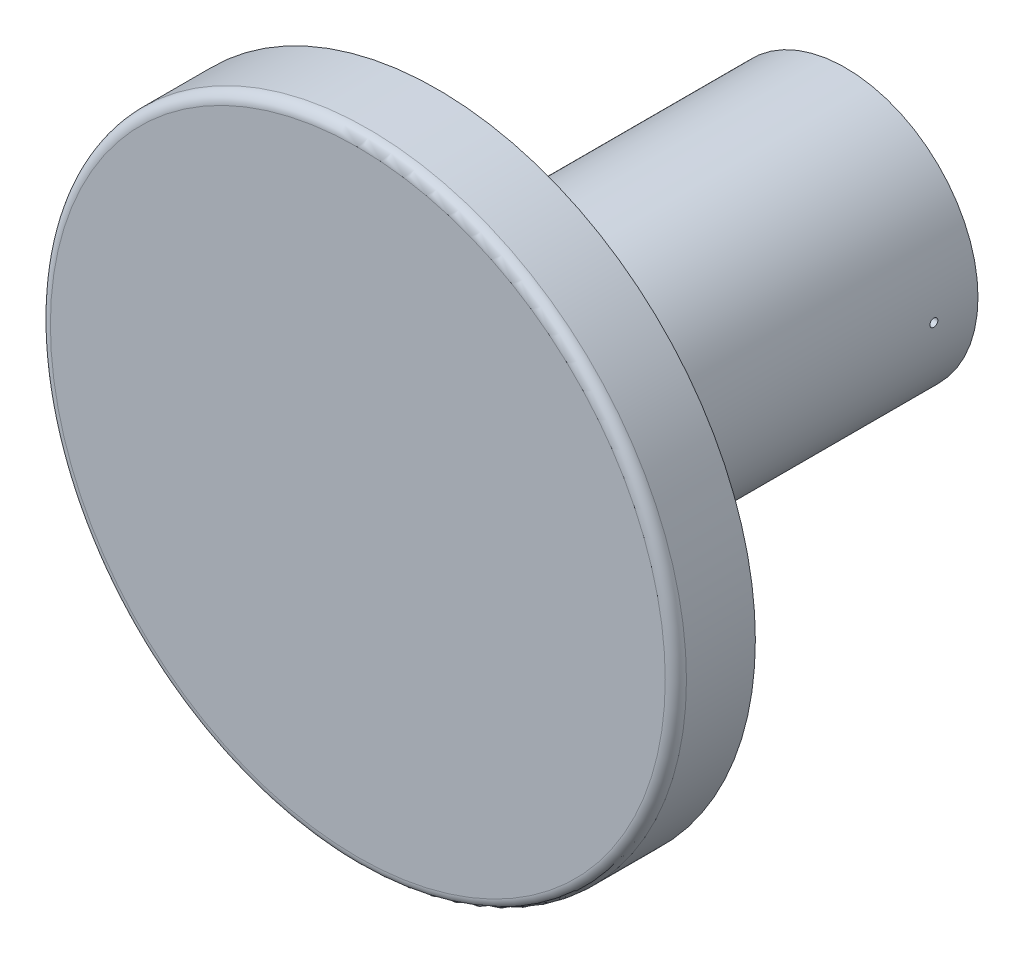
ISO-10303-21;
HEADER;
FILE_DESCRIPTION(('STEP AP214'),'2;1');
FILE_NAME('part.step','',(''),(''),'','','');
FILE_SCHEMA(('AUTOMOTIVE_DESIGN { 1 0 10303 214 1 1 1 1 }'));
ENDSEC;
DATA;
#1=APPLICATION_CONTEXT('core data for automotive mechanical design processes');
#2=APPLICATION_PROTOCOL_DEFINITION('international standard','automotive_design',2000,#1);
#3=PRODUCT_CONTEXT('',#1,'mechanical');
#4=PRODUCT('Part','Part','',(#3));
#5=PRODUCT_RELATED_PRODUCT_CATEGORY('part','',(#4));
#6=PRODUCT_DEFINITION_FORMATION('','',#4);
#7=PRODUCT_DEFINITION_CONTEXT('part definition',#1,'design');
#8=PRODUCT_DEFINITION('design','',#6,#7);
#9=PRODUCT_DEFINITION_SHAPE('','',#8);
#10=(LENGTH_UNIT() NAMED_UNIT(*) SI_UNIT(.MILLI.,.METRE.));
#11=(NAMED_UNIT(*) PLANE_ANGLE_UNIT() SI_UNIT($,.RADIAN.));
#12=(NAMED_UNIT(*) SI_UNIT($,.STERADIAN.) SOLID_ANGLE_UNIT());
#13=UNCERTAINTY_MEASURE_WITH_UNIT(LENGTH_MEASURE(1.E-05),#10,'distance_accuracy_value','');
#14=(GEOMETRIC_REPRESENTATION_CONTEXT(3) GLOBAL_UNCERTAINTY_ASSIGNED_CONTEXT((#13)) GLOBAL_UNIT_ASSIGNED_CONTEXT((#10,
#11,#12)) REPRESENTATION_CONTEXT('',''));
#15=CARTESIAN_POINT('',(0.,0.,0.));
#16=DIRECTION('',(0.,0.,1.));
#17=DIRECTION('',(1.,0.,0.));
#18=AXIS2_PLACEMENT_3D('',#15,#16,#17);
#19=CARTESIAN_POINT('',(0.,6.,7.5));
#20=DIRECTION('',(0.,0.,-1.));
#21=DIRECTION('',(-1.,0.,0.));
#22=AXIS2_PLACEMENT_3D('',#19,#20,#21);
#23=CYLINDRICAL_SURFACE('',#22,2.5);
#24=CARTESIAN_POINT('',(0.,6.,7.5));
#25=DIRECTION('',(0.,0.,1.));
#26=DIRECTION('',(1.,0.,0.));
#27=AXIS2_PLACEMENT_3D('',#24,#25,#26);
#28=CIRCLE('',#27,2.5);
#29=CARTESIAN_POINT('',(2.5,6.,7.5));
#30=VERTEX_POINT('',#29);
#31=EDGE_CURVE('E11',#30,#30,#28,.T.);
#32=ORIENTED_EDGE('',*,*,#31,.F.);
#33=EDGE_LOOP('',(#32));
#34=FACE_BOUND('',#33,.T.);
#35=CARTESIAN_POINT('',(0.,6.,0.));
#36=DIRECTION('',(0.,0.,1.));
#37=DIRECTION('',(1.,0.,0.));
#38=AXIS2_PLACEMENT_3D('',#35,#36,#37);
#39=CIRCLE('',#38,2.5);
#40=CARTESIAN_POINT('',(2.5,6.,0.));
#41=VERTEX_POINT('',#40);
#42=EDGE_CURVE('E58',#41,#41,#39,.T.);
#43=ORIENTED_EDGE('',*,*,#42,.T.);
#44=EDGE_LOOP('',(#43));
#45=FACE_BOUND('',#44,.T.);
#46=CARTESIAN_POINT('',(2.5,6.,0.907063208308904));
#47=CARTESIAN_POINT('',(2.49999998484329,5.99578823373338,0.907063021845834));
#48=CARTESIAN_POINT('',(2.49998924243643,5.99157343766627,0.906707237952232));
#49=CARTESIAN_POINT('',(2.49994742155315,5.9832599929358,0.905292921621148));
#50=CARTESIAN_POINT('',(2.4999163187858,5.97916148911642,0.904233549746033));
#51=CARTESIAN_POINT('',(2.49983729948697,5.9712022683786,0.901442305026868));
#52=CARTESIAN_POINT('',(2.49978939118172,5.96734143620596,0.899710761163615));
#53=CARTESIAN_POINT('',(2.49968216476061,5.95996632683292,0.895624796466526));
#54=CARTESIAN_POINT('',(2.499622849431,5.9564519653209,0.893270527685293));
#55=CARTESIAN_POINT('',(2.49949945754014,5.94986687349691,0.88800468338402));
#56=CARTESIAN_POINT('',(2.49943537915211,5.9467963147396,0.885092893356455));
#57=CARTESIAN_POINT('',(2.49930969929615,5.94118743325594,0.878795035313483));
#58=CARTESIAN_POINT('',(2.49924809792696,5.93864913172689,0.875408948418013));
#59=CARTESIAN_POINT('',(2.4991343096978,5.93417655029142,0.868257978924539));
#60=CARTESIAN_POINT('',(2.49908212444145,5.93224237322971,0.864493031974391));
#61=CARTESIAN_POINT('',(2.49899306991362,5.9290336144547,0.85669167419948));
#62=CARTESIAN_POINT('',(2.49895620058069,5.92775903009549,0.852655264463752));
#63=CARTESIAN_POINT('',(2.49890194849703,5.92590600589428,0.844426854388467));
#64=CARTESIAN_POINT('',(2.49888455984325,5.92532735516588,0.840234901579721));
#65=CARTESIAN_POINT('',(2.49887121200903,5.92488197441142,0.831813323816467));
#66=CARTESIAN_POINT('',(2.49887525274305,5.92501524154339,0.827583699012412));
#67=CARTESIAN_POINT('',(2.49890430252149,5.92598973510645,0.819208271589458));
#68=CARTESIAN_POINT('',(2.49892930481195,5.92683073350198,0.815062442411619));
#69=CARTESIAN_POINT('',(2.49899744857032,5.9291964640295,0.806970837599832));
#70=CARTESIAN_POINT('',(2.49904059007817,5.93072119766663,0.80302506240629));
#71=CARTESIAN_POINT('',(2.4991401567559,5.93441137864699,0.795444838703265));
#72=CARTESIAN_POINT('',(2.49919658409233,5.93657693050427,0.791810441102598));
#73=CARTESIAN_POINT('',(2.49931635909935,5.94148719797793,0.784956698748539));
#74=CARTESIAN_POINT('',(2.49937970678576,5.94423191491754,0.781737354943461));
#75=CARTESIAN_POINT('',(2.49950621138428,5.95022389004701,0.775803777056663));
#76=CARTESIAN_POINT('',(2.4995693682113,5.95347134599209,0.773089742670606));
#77=CARTESIAN_POINT('',(2.49968834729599,5.96037591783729,0.768245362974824));
#78=CARTESIAN_POINT('',(2.49974416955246,5.9640330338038,0.766115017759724));
#79=CARTESIAN_POINT('',(2.4998421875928,5.97165322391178,0.762498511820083));
#80=CARTESIAN_POINT('',(2.49988438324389,5.97561630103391,0.761012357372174));
#81=CARTESIAN_POINT('',(2.49995038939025,5.98373586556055,0.758726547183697));
#82=CARTESIAN_POINT('',(2.49997419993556,5.98789235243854,0.757926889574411));
#83=CARTESIAN_POINT('',(2.50000074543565,5.99627901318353,0.757037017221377));
#84=CARTESIAN_POINT('',(2.50000348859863,6.00050915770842,0.756946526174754));
#85=CARTESIAN_POINT('',(2.49998761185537,6.00892457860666,0.757476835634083));
#86=CARTESIAN_POINT('',(2.49996899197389,6.013109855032,0.75809763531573));
#87=CARTESIAN_POINT('',(2.49991249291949,6.02131596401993,0.760032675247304));
#88=CARTESIAN_POINT('',(2.49987461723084,6.02533682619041,0.761346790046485));
#89=CARTESIAN_POINT('',(2.49978387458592,6.03310087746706,0.76463102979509));
#90=CARTESIAN_POINT('',(2.49973100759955,6.03684406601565,0.76660115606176));
#91=CARTESIAN_POINT('',(2.49961621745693,6.04394778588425,0.771142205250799));
#92=CARTESIAN_POINT('',(2.49955429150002,6.04730819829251,0.773713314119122));
#93=CARTESIAN_POINT('',(2.49942837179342,6.05354978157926,0.779383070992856));
#94=CARTESIAN_POINT('',(2.49936437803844,6.05643095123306,0.782481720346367));
#95=CARTESIAN_POINT('',(2.49924151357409,6.06163318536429,0.789119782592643));
#96=CARTESIAN_POINT('',(2.49918264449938,6.06395407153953,0.792659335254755));
#97=CARTESIAN_POINT('',(2.49907669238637,6.06796863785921,0.80007801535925));
#98=CARTESIAN_POINT('',(2.49902960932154,6.06966231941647,0.803957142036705));
#99=CARTESIAN_POINT('',(2.49895254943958,6.07237408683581,0.811944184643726));
#100=CARTESIAN_POINT('',(2.49892256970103,6.07339228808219,0.816052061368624));
#101=CARTESIAN_POINT('',(2.49888308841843,6.07472457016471,0.824380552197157));
#102=CARTESIAN_POINT('',(2.49887358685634,6.07503865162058,0.828601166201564));
#103=CARTESIAN_POINT('',(2.4988761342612,6.07495376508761,0.837033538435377));
#104=CARTESIAN_POINT('',(2.498888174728,6.07455507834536,0.841245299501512));
#105=CARTESIAN_POINT('',(2.49893243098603,6.07305655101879,0.849542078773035));
#106=CARTESIAN_POINT('',(2.49896464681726,6.07195670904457,0.853627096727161));
#107=CARTESIAN_POINT('',(2.4990456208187,6.06908713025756,0.861554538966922));
#108=CARTESIAN_POINT('',(2.49909437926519,6.06731738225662,0.865396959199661));
#109=CARTESIAN_POINT('',(2.49920293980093,6.06315832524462,0.872730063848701));
#110=CARTESIAN_POINT('',(2.49926274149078,6.06076903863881,0.876220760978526));
#111=CARTESIAN_POINT('',(2.49938667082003,6.05543790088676,0.882752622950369));
#112=CARTESIAN_POINT('',(2.49945079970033,6.05249589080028,0.885793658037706));
#113=CARTESIAN_POINT('',(2.49957615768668,6.04614223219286,0.891339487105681));
#114=CARTESIAN_POINT('',(2.49963738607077,6.0427304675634,0.893844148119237));
#115=CARTESIAN_POINT('',(2.49975006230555,6.03553281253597,0.898246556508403));
#116=CARTESIAN_POINT('',(2.49980150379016,6.03174668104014,0.900143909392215));
#117=CARTESIAN_POINT('',(2.49988869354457,6.02391237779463,0.903273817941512));
#118=CARTESIAN_POINT('',(2.49992446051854,6.01986452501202,0.904507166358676));
#119=CARTESIAN_POINT('',(2.4999667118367,6.01315925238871,0.905947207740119));
#120=CARTESIAN_POINT('',(2.49997914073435,6.01054535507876,0.906365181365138));
#121=CARTESIAN_POINT('',(2.49999578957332,6.00528803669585,0.906923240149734));
#122=CARTESIAN_POINT('',(2.50000000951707,6.00264461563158,0.907063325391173));
#123=CARTESIAN_POINT('',(2.5,6.,0.907063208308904));
#124=B_SPLINE_CURVE_WITH_KNOTS('',3,(#46,#47,#48,#49,#50,#51,#52,#53,#54,#55,#56,#57,#58,#59,
#60,#61,#62,#63,#64,#65,#66,#67,#68,#69,#70,#71,#72,#73,#74,#75,#76,#77,#78,#79,#80,#81,#82,#83,
#84,#85,#86,#87,#88,#89,#90,#91,#92,#93,#94,#95,#96,#97,#98,#99,#100,#101,#102,#103,#104,#105,
#106,#107,#108,#109,#110,#111,#112,#113,#114,#115,#116,#117,#118,#119,#120,#121,#122,#123),
.UNSPECIFIED.,.T.,.F.,(4,2,2,2,2,2,2,2,2,2,2,2,2,2,2,2,2,2,2,2,2,2,2,2,2,2,2,2,2,2,2,2,2,2,2,2,
2,2,4),(0.,0.0126256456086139,0.0252663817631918,0.0379009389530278,0.0505324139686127,
0.0631687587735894,0.0758056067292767,0.088444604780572,0.101083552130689,0.113718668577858,
0.126353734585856,0.13898473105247,0.151615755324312,0.164248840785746,0.176881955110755,
0.189520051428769,0.202158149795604,0.214796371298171,0.227434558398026,0.240067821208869,
0.252701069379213,0.265332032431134,0.2779630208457,0.29059792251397,0.303232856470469,
0.315871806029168,0.32851072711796,0.341147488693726,0.353784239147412,0.366416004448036,
0.379047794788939,0.391679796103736,0.404311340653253,0.416946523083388,0.429584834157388,
0.442231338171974,0.45486270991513,0.462790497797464,0.470718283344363),.UNSPECIFIED.);
#125=CARTESIAN_POINT('',(2.5,6.,0.907063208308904));
#126=VERTEX_POINT('',#125);
#127=EDGE_CURVE('E93',#126,#126,#124,.T.);
#128=ORIENTED_EDGE('',*,*,#127,.F.);
#129=EDGE_LOOP('',(#128));
#130=FACE_BOUND('',#129,.T.);
#131=CARTESIAN_POINT('',(-2.5,6.,0.907063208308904));
#132=CARTESIAN_POINT('',(-2.49999998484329,6.00421176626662,0.907063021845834));
#133=CARTESIAN_POINT('',(-2.49998924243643,6.00842656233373,0.906707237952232));
#134=CARTESIAN_POINT('',(-2.49994742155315,6.0167400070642,0.905292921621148));
#135=CARTESIAN_POINT('',(-2.4999163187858,6.02083851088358,0.904233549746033));
#136=CARTESIAN_POINT('',(-2.49983729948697,6.0287977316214,0.901442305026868));
#137=CARTESIAN_POINT('',(-2.49978939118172,6.03265856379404,0.899710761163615));
#138=CARTESIAN_POINT('',(-2.49968216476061,6.04003367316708,0.895624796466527));
#139=CARTESIAN_POINT('',(-2.499622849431,6.0435480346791,0.893270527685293));
#140=CARTESIAN_POINT('',(-2.49949945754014,6.05013312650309,0.88800468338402));
#141=CARTESIAN_POINT('',(-2.49943537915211,6.0532036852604,0.885092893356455));
#142=CARTESIAN_POINT('',(-2.49930969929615,6.05881256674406,0.878795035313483));
#143=CARTESIAN_POINT('',(-2.49924809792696,6.06135086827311,0.875408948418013));
#144=CARTESIAN_POINT('',(-2.4991343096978,6.06582344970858,0.868257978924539));
#145=CARTESIAN_POINT('',(-2.49908212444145,6.06775762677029,0.864493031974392));
#146=CARTESIAN_POINT('',(-2.49899306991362,6.0709663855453,0.856691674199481));
#147=CARTESIAN_POINT('',(-2.49895620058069,6.07224096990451,0.852655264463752));
#148=CARTESIAN_POINT('',(-2.49890194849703,6.07409399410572,0.844426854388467));
#149=CARTESIAN_POINT('',(-2.49888455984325,6.07467264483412,0.840234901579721));
#150=CARTESIAN_POINT('',(-2.49887121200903,6.07511802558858,0.831813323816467));
#151=CARTESIAN_POINT('',(-2.49887525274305,6.07498475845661,0.827583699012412));
#152=CARTESIAN_POINT('',(-2.49890430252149,6.07401026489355,0.819208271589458));
#153=CARTESIAN_POINT('',(-2.49892930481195,6.07316926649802,0.815062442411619));
#154=CARTESIAN_POINT('',(-2.49899744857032,6.0708035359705,0.806970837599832));
#155=CARTESIAN_POINT('',(-2.49904059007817,6.06927880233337,0.80302506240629));
#156=CARTESIAN_POINT('',(-2.4991401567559,6.06558862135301,0.795444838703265));
#157=CARTESIAN_POINT('',(-2.49919658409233,6.06342306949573,0.791810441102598));
#158=CARTESIAN_POINT('',(-2.49931635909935,6.05851280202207,0.784956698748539));
#159=CARTESIAN_POINT('',(-2.49937970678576,6.05576808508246,0.781737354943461));
#160=CARTESIAN_POINT('',(-2.49950621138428,6.049776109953,0.775803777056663));
#161=CARTESIAN_POINT('',(-2.4995693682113,6.04652865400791,0.773089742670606));
#162=CARTESIAN_POINT('',(-2.49968834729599,6.03962408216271,0.768245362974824));
#163=CARTESIAN_POINT('',(-2.49974416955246,6.0359669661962,0.766115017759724));
#164=CARTESIAN_POINT('',(-2.4998421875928,6.02834677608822,0.762498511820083));
#165=CARTESIAN_POINT('',(-2.49988438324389,6.02438369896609,0.761012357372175));
#166=CARTESIAN_POINT('',(-2.49995038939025,6.01626413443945,0.758726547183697));
#167=CARTESIAN_POINT('',(-2.49997419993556,6.01210764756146,0.757926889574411));
#168=CARTESIAN_POINT('',(-2.50000074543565,6.00372098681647,0.757037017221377));
#169=CARTESIAN_POINT('',(-2.50000348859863,5.99949084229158,0.756946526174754));
#170=CARTESIAN_POINT('',(-2.49998761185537,5.99107542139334,0.757476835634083));
#171=CARTESIAN_POINT('',(-2.49996899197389,5.986890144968,0.75809763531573));
#172=CARTESIAN_POINT('',(-2.49991249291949,5.97868403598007,0.760032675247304));
#173=CARTESIAN_POINT('',(-2.49987461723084,5.97466317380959,0.761346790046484));
#174=CARTESIAN_POINT('',(-2.49978387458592,5.96689912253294,0.764631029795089));
#175=CARTESIAN_POINT('',(-2.49973100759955,5.96315593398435,0.76660115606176));
#176=CARTESIAN_POINT('',(-2.49961621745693,5.95605221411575,0.771142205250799));
#177=CARTESIAN_POINT('',(-2.49955429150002,5.95269180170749,0.773713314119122));
#178=CARTESIAN_POINT('',(-2.49942837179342,5.94645021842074,0.779383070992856));
#179=CARTESIAN_POINT('',(-2.49936437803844,5.94356904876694,0.782481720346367));
#180=CARTESIAN_POINT('',(-2.49924151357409,5.93836681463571,0.789119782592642));
#181=CARTESIAN_POINT('',(-2.49918264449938,5.93604592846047,0.792659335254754));
#182=CARTESIAN_POINT('',(-2.49907669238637,5.93203136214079,0.800078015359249));
#183=CARTESIAN_POINT('',(-2.49902960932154,5.93033768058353,0.803957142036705));
#184=CARTESIAN_POINT('',(-2.49895254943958,5.92762591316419,0.811944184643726));
#185=CARTESIAN_POINT('',(-2.49892256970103,5.92660771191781,0.816052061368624));
#186=CARTESIAN_POINT('',(-2.49888308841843,5.92527542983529,0.824380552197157));
#187=CARTESIAN_POINT('',(-2.49887358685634,5.92496134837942,0.828601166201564));
#188=CARTESIAN_POINT('',(-2.4988761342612,5.92504623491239,0.837033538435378));
#189=CARTESIAN_POINT('',(-2.498888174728,5.92544492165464,0.841245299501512));
#190=CARTESIAN_POINT('',(-2.49893243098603,5.92694344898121,0.849542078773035));
#191=CARTESIAN_POINT('',(-2.49896464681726,5.92804329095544,0.853627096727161));
#192=CARTESIAN_POINT('',(-2.4990456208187,5.93091286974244,0.861554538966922));
#193=CARTESIAN_POINT('',(-2.49909437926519,5.93268261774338,0.865396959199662));
#194=CARTESIAN_POINT('',(-2.49920293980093,5.93684167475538,0.872730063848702));
#195=CARTESIAN_POINT('',(-2.49926274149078,5.93923096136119,0.876220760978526));
#196=CARTESIAN_POINT('',(-2.49938667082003,5.94456209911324,0.882752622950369));
#197=CARTESIAN_POINT('',(-2.49945079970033,5.94750410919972,0.885793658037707));
#198=CARTESIAN_POINT('',(-2.49957615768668,5.95385776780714,0.891339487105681));
#199=CARTESIAN_POINT('',(-2.49963738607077,5.9572695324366,0.893844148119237));
#200=CARTESIAN_POINT('',(-2.49975006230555,5.96446718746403,0.898246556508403));
#201=CARTESIAN_POINT('',(-2.49980150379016,5.96825331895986,0.900143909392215));
#202=CARTESIAN_POINT('',(-2.49988869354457,5.97608762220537,0.903273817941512));
#203=CARTESIAN_POINT('',(-2.49992446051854,5.98013547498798,0.904507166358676));
#204=CARTESIAN_POINT('',(-2.4999667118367,5.98684074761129,0.905947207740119));
#205=CARTESIAN_POINT('',(-2.49997914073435,5.98945464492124,0.906365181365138));
#206=CARTESIAN_POINT('',(-2.49999578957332,5.99471196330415,0.906923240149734));
#207=CARTESIAN_POINT('',(-2.50000000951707,5.99735538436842,0.907063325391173));
#208=CARTESIAN_POINT('',(-2.5,6.,0.907063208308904));
#209=B_SPLINE_CURVE_WITH_KNOTS('',3,(#131,#132,#133,#134,#135,#136,#137,#138,#139,#140,#141,
#142,#143,#144,#145,#146,#147,#148,#149,#150,#151,#152,#153,#154,#155,#156,#157,#158,#159,#160,
#161,#162,#163,#164,#165,#166,#167,#168,#169,#170,#171,#172,#173,#174,#175,#176,#177,#178,#179,
#180,#181,#182,#183,#184,#185,#186,#187,#188,#189,#190,#191,#192,#193,#194,#195,#196,#197,#198,
#199,#200,#201,#202,#203,#204,#205,#206,#207,#208),.UNSPECIFIED.,.T.,.F.,(4,2,2,2,2,2,2,2,2,2,2,
2,2,2,2,2,2,2,2,2,2,2,2,2,2,2,2,2,2,2,2,2,2,2,2,2,2,2,4),(0.,0.0126256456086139,
0.0252663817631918,0.0379009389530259,0.0505324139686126,0.0631687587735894,0.0758056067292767,
0.0884446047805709,0.101083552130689,0.113718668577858,0.126353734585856,0.13898473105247,
0.151615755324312,0.164248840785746,0.176881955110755,0.189520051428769,0.202158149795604,
0.21479637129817,0.227434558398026,0.240067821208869,0.252701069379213,0.265332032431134,
0.2779630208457,0.29059792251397,0.303232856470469,0.315871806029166,0.32851072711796,
0.341147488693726,0.353784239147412,0.366416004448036,0.379047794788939,0.391679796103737,
0.404311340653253,0.416946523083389,0.429584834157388,0.442231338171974,0.45486270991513,
0.462790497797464,0.470718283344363),.UNSPECIFIED.);
#210=CARTESIAN_POINT('',(-2.5,6.,0.907063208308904));
#211=VERTEX_POINT('',#210);
#212=EDGE_CURVE('E98',#211,#211,#209,.T.);
#213=ORIENTED_EDGE('',*,*,#212,.F.);
#214=EDGE_LOOP('',(#213));
#215=FACE_BOUND('',#214,.T.);
#216=ADVANCED_FACE('F45',(#34,#45,#130,#215),#23,.T.);
#217=CARTESIAN_POINT('',(0.,6.,7.1));
#218=DIRECTION('',(0.,0.,-1.));
#219=DIRECTION('',(-1.,0.,0.));
#220=AXIS2_PLACEMENT_3D('',#217,#218,#219);
#221=CYLINDRICAL_SURFACE('',#220,2.12733);
#222=CARTESIAN_POINT('',(0.,6.,7.1));
#223=DIRECTION('',(0.,0.,-1.));
#224=DIRECTION('',(-1.,0.,0.));
#225=AXIS2_PLACEMENT_3D('',#222,#223,#224);
#226=CIRCLE('',#225,2.12733);
#227=CARTESIAN_POINT('',(-2.12733,6.,7.1));
#228=VERTEX_POINT('',#227);
#229=EDGE_CURVE('E71',#228,#228,#226,.T.);
#230=ORIENTED_EDGE('',*,*,#229,.F.);
#231=EDGE_LOOP('',(#230));
#232=FACE_BOUND('',#231,.T.);
#233=CARTESIAN_POINT('',(0.,6.,0.1));
#234=DIRECTION('',(0.,0.,-1.));
#235=DIRECTION('',(-1.,0.,0.));
#236=AXIS2_PLACEMENT_3D('',#233,#234,#235);
#237=CIRCLE('',#236,2.12733);
#238=CARTESIAN_POINT('',(-2.12733,6.,0.1));
#239=VERTEX_POINT('',#238);
#240=EDGE_CURVE('E104',#239,#239,#237,.T.);
#241=ORIENTED_EDGE('',*,*,#240,.T.);
#242=EDGE_LOOP('',(#241));
#243=FACE_BOUND('',#242,.T.);
#244=CARTESIAN_POINT('',(2.12733,6.,0.907063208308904));
#245=CARTESIAN_POINT('',(2.12732998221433,6.00421137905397,0.907063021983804));
#246=CARTESIAN_POINT('',(2.12731736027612,6.00842577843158,0.906707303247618));
#247=CARTESIAN_POINT('',(2.12726822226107,6.01673841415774,0.905293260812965));
#248=CARTESIAN_POINT('',(2.12723167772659,6.02083650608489,0.904234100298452));
#249=CARTESIAN_POINT('',(2.12713883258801,6.02879490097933,0.901443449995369));
#250=CARTESIAN_POINT('',(2.12708254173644,6.03265532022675,0.899712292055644));
#251=CARTESIAN_POINT('',(2.12695655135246,6.04002968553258,0.89562727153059));
#252=CARTESIAN_POINT('',(2.12688685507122,6.04354371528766,0.893273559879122));
#253=CARTESIAN_POINT('',(2.12674185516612,6.0501286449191,0.888008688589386));
#254=CARTESIAN_POINT('',(2.12666654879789,6.05319932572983,0.885097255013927));
#255=CARTESIAN_POINT('',(2.1265188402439,6.05880854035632,0.878800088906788));
#256=CARTESIAN_POINT('',(2.12644643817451,6.06134705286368,0.875414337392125));
#257=CARTESIAN_POINT('',(2.12631268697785,6.0658203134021,0.868263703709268));
#258=CARTESIAN_POINT('',(2.1262513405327,6.06775491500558,0.864498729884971));
#259=CARTESIAN_POINT('',(2.12614664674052,6.07096449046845,0.856697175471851));
#260=CARTESIAN_POINT('',(2.12610329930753,6.0722394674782,0.852660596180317));
#261=CARTESIAN_POINT('',(2.12603951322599,6.07409309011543,0.844432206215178));
#262=CARTESIAN_POINT('',(2.12601906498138,6.07467202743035,0.840240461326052));
#263=CARTESIAN_POINT('',(2.1260033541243,6.07511803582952,0.831819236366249));
#264=CARTESIAN_POINT('',(2.12600809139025,6.07498511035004,0.827589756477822));
#265=CARTESIAN_POINT('',(2.12604220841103,6.07401141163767,0.819215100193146));
#266=CARTESIAN_POINT('',(2.12607157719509,6.07317095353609,0.815069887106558));
#267=CARTESIAN_POINT('',(2.12615162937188,6.07080653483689,0.8069794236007));
#268=CARTESIAN_POINT('',(2.12620231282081,6.06928257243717,0.803034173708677));
#269=CARTESIAN_POINT('',(2.12631929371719,6.06559404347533,0.795454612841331));
#270=CARTESIAN_POINT('',(2.12638559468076,6.06342933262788,0.791820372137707));
#271=CARTESIAN_POINT('',(2.12652633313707,6.05852086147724,0.784966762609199));
#272=CARTESIAN_POINT('',(2.12660077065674,6.05577709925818,0.781747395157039));
#273=CARTESIAN_POINT('',(2.12674944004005,6.04978662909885,0.775813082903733));
#274=CARTESIAN_POINT('',(2.12682367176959,6.04653964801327,0.773098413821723));
#275=CARTESIAN_POINT('',(2.12696352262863,6.0396358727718,0.768252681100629));
#276=CARTESIAN_POINT('',(2.12702914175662,6.03597907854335,0.766121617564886));
#277=CARTESIAN_POINT('',(2.12714437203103,6.02835932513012,0.762503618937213));
#278=CARTESIAN_POINT('',(2.12719398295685,6.02439636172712,0.761016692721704));
#279=CARTESIAN_POINT('',(2.12727160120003,6.0162768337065,0.758729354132));
#280=CARTESIAN_POINT('',(2.12729960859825,6.01212026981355,0.757928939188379));
#281=CARTESIAN_POINT('',(2.12733085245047,6.00373392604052,0.757037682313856));
#282=CARTESIAN_POINT('',(2.12733410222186,5.99950418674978,0.756946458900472));
#283=CARTESIAN_POINT('',(2.12731549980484,5.99108945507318,0.757475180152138));
#284=CARTESIAN_POINT('',(2.12729364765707,5.9869044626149,0.758095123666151));
#285=CARTESIAN_POINT('',(2.12722731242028,5.97869908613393,0.760028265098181));
#286=CARTESIAN_POINT('',(2.12718283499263,5.97467866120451,0.761341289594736));
#287=CARTESIAN_POINT('',(2.1270762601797,5.96691528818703,0.764623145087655));
#288=CARTESIAN_POINT('',(2.1270141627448,5.96317234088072,0.766591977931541));
#289=CARTESIAN_POINT('',(2.12687930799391,5.9560684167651,0.771130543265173));
#290=CARTESIAN_POINT('',(2.12680654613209,5.95270760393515,0.773700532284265));
#291=CARTESIAN_POINT('',(2.12665857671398,5.94646499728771,0.779368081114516));
#292=CARTESIAN_POINT('',(2.12658336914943,5.94358320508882,0.782465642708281));
#293=CARTESIAN_POINT('',(2.1264389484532,5.9383791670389,0.789102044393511));
#294=CARTESIAN_POINT('',(2.12636973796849,5.9360571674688,0.792641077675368));
#295=CARTESIAN_POINT('',(2.12624515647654,5.9320403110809,0.800058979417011));
#296=CARTESIAN_POINT('',(2.12618978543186,5.93034545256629,0.803937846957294));
#297=CARTESIAN_POINT('',(2.12609914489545,5.92763142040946,0.811924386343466));
#298=CARTESIAN_POINT('',(2.12606387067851,5.92661208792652,0.816032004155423));
#299=CARTESIAN_POINT('',(2.12601738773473,5.92527752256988,0.824360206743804));
#300=CARTESIAN_POINT('',(2.12600617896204,5.92496228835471,0.828580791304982));
#301=CARTESIAN_POINT('',(2.12600909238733,5.9250448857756,0.837012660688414));
#302=CARTESIAN_POINT('',(2.12602320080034,5.92544232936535,0.841223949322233));
#303=CARTESIAN_POINT('',(2.12607512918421,5.92693820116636,0.849519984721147));
#304=CARTESIAN_POINT('',(2.12611294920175,5.92803663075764,0.853604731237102));
#305=CARTESIAN_POINT('',(2.12620803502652,5.93090323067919,0.861531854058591));
#306=CARTESIAN_POINT('',(2.12626530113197,5.93267141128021,0.865374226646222));
#307=CARTESIAN_POINT('',(2.12639282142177,5.93682721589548,0.872707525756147));
#308=CARTESIAN_POINT('',(2.12646307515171,5.93921481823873,0.876198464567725));
#309=CARTESIAN_POINT('',(2.12660869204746,5.94454294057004,0.882731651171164));
#310=CARTESIAN_POINT('',(2.12668405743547,5.94748370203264,0.885773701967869));
#311=CARTESIAN_POINT('',(2.12683139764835,5.95383504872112,0.891321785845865));
#312=CARTESIAN_POINT('',(2.12690337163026,5.95724574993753,0.893827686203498));
#313=CARTESIAN_POINT('',(2.12703584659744,5.96444177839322,0.898232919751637));
#314=CARTESIAN_POINT('',(2.12709633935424,5.96822737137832,0.900131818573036));
#315=CARTESIAN_POINT('',(2.12719889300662,5.97606094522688,0.903264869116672));
#316=CARTESIAN_POINT('',(2.12724097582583,5.98010860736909,0.904499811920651));
#317=CARTESIAN_POINT('',(2.12729074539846,5.98681812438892,0.905943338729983));
#318=CARTESIAN_POINT('',(2.12730540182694,5.98943644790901,0.906362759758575));
#319=CARTESIAN_POINT('',(2.12732503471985,5.99470278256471,0.906922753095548));
#320=CARTESIAN_POINT('',(2.12733001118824,5.99735079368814,0.907063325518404));
#321=CARTESIAN_POINT('',(2.12733,6.,0.907063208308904));
#322=B_SPLINE_CURVE_WITH_KNOTS('',3,(#244,#245,#246,#247,#248,#249,#250,#251,#252,#253,#254,
#255,#256,#257,#258,#259,#260,#261,#262,#263,#264,#265,#266,#267,#268,#269,#270,#271,#272,#273,
#274,#275,#276,#277,#278,#279,#280,#281,#282,#283,#284,#285,#286,#287,#288,#289,#290,#291,#292,
#293,#294,#295,#296,#297,#298,#299,#300,#301,#302,#303,#304,#305,#306,#307,#308,#309,#310,#311,
#312,#313,#314,#315,#316,#317,#318,#319,#320,#321),.UNSPECIFIED.,.T.,.F.,(4,2,2,2,2,2,2,2,2,2,2,
2,2,2,2,2,2,2,2,2,2,2,2,2,2,2,2,2,2,2,2,2,2,2,2,2,2,2,4),(0.,0.0126244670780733,
0.0252639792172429,0.0378972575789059,0.0505274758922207,0.0631639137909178,0.0758008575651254,
0.0884408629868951,0.101080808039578,0.113715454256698,0.126350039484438,0.138979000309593,
0.151607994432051,0.164239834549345,0.176871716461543,0.189510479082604,0.202149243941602,
0.214788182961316,0.227427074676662,0.240059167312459,0.252691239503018,0.265320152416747,
0.277949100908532,0.290583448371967,0.303217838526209,0.315857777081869,0.328497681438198,
0.341134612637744,0.353771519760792,0.366401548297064,0.37903160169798,0.391661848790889,
0.404291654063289,0.416926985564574,0.429565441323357,0.442212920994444,0.45484529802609,
0.462786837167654,0.47072837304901),.UNSPECIFIED.);
#323=CARTESIAN_POINT('',(2.12733,6.,0.907063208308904));
#324=VERTEX_POINT('',#323);
#325=EDGE_CURVE('E72',#324,#324,#322,.T.);
#326=ORIENTED_EDGE('',*,*,#325,.F.);
#327=EDGE_LOOP('',(#326));
#328=FACE_BOUND('',#327,.T.);
#329=CARTESIAN_POINT('',(-2.12733,6.,0.907063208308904));
#330=CARTESIAN_POINT('',(-2.12732998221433,5.99578862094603,0.907063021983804));
#331=CARTESIAN_POINT('',(-2.12731736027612,5.99157422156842,0.906707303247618));
#332=CARTESIAN_POINT('',(-2.12726822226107,5.98326158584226,0.905293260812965));
#333=CARTESIAN_POINT('',(-2.12723167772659,5.97916349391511,0.904234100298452));
#334=CARTESIAN_POINT('',(-2.12713883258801,5.97120509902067,0.901443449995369));
#335=CARTESIAN_POINT('',(-2.12708254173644,5.96734467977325,0.899712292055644));
#336=CARTESIAN_POINT('',(-2.12695655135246,5.95997031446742,0.89562727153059));
#337=CARTESIAN_POINT('',(-2.12688685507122,5.95645628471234,0.893273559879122));
#338=CARTESIAN_POINT('',(-2.12674185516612,5.9498713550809,0.888008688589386));
#339=CARTESIAN_POINT('',(-2.12666654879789,5.94680067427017,0.885097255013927));
#340=CARTESIAN_POINT('',(-2.1265188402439,5.94119145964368,0.878800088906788));
#341=CARTESIAN_POINT('',(-2.12644643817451,5.93865294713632,0.875414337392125));
#342=CARTESIAN_POINT('',(-2.12631268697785,5.9341796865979,0.868263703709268));
#343=CARTESIAN_POINT('',(-2.1262513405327,5.93224508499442,0.864498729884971));
#344=CARTESIAN_POINT('',(-2.12614664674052,5.92903550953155,0.856697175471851));
#345=CARTESIAN_POINT('',(-2.12610329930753,5.9277605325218,0.852660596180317));
#346=CARTESIAN_POINT('',(-2.12603951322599,5.92590690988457,0.844432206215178));
#347=CARTESIAN_POINT('',(-2.12601906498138,5.92532797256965,0.840240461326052));
#348=CARTESIAN_POINT('',(-2.1260033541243,5.92488196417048,0.831819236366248));
#349=CARTESIAN_POINT('',(-2.12600809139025,5.92501488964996,0.827589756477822));
#350=CARTESIAN_POINT('',(-2.12604220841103,5.92598858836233,0.819215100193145));
#351=CARTESIAN_POINT('',(-2.12607157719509,5.92682904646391,0.815069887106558));
#352=CARTESIAN_POINT('',(-2.12615162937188,5.92919346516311,0.8069794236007));
#353=CARTESIAN_POINT('',(-2.12620231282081,5.93071742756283,0.803034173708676));
#354=CARTESIAN_POINT('',(-2.12631929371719,5.93440595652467,0.795454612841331));
#355=CARTESIAN_POINT('',(-2.12638559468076,5.93657066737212,0.791820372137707));
#356=CARTESIAN_POINT('',(-2.12652633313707,5.94147913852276,0.784966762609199));
#357=CARTESIAN_POINT('',(-2.12660077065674,5.94422290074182,0.781747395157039));
#358=CARTESIAN_POINT('',(-2.12674944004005,5.95021337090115,0.775813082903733));
#359=CARTESIAN_POINT('',(-2.12682367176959,5.95346035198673,0.773098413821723));
#360=CARTESIAN_POINT('',(-2.12696352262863,5.9603641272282,0.768252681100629));
#361=CARTESIAN_POINT('',(-2.12702914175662,5.96402092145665,0.766121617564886));
#362=CARTESIAN_POINT('',(-2.12714437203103,5.97164067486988,0.762503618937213));
#363=CARTESIAN_POINT('',(-2.12719398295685,5.97560363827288,0.761016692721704));
#364=CARTESIAN_POINT('',(-2.12727160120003,5.9837231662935,0.758729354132));
#365=CARTESIAN_POINT('',(-2.12729960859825,5.98787973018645,0.757928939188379));
#366=CARTESIAN_POINT('',(-2.12733085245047,5.99626607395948,0.757037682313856));
#367=CARTESIAN_POINT('',(-2.12733410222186,6.00049581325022,0.756946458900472));
#368=CARTESIAN_POINT('',(-2.12731549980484,6.00891054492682,0.757475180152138));
#369=CARTESIAN_POINT('',(-2.12729364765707,6.0130955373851,0.758095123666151));
#370=CARTESIAN_POINT('',(-2.12722731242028,6.02130091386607,0.760028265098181));
#371=CARTESIAN_POINT('',(-2.12718283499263,6.02532133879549,0.761341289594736));
#372=CARTESIAN_POINT('',(-2.1270762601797,6.03308471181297,0.764623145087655));
#373=CARTESIAN_POINT('',(-2.1270141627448,6.03682765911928,0.766591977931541));
#374=CARTESIAN_POINT('',(-2.12687930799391,6.0439315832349,0.771130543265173));
#375=CARTESIAN_POINT('',(-2.12680654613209,6.04729239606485,0.773700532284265));
#376=CARTESIAN_POINT('',(-2.12665857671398,6.0535350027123,0.779368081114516));
#377=CARTESIAN_POINT('',(-2.12658336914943,6.05641679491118,0.782465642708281));
#378=CARTESIAN_POINT('',(-2.1264389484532,6.0616208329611,0.789102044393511));
#379=CARTESIAN_POINT('',(-2.12636973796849,6.0639428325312,0.792641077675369));
#380=CARTESIAN_POINT('',(-2.12624515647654,6.0679596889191,0.800058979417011));
#381=CARTESIAN_POINT('',(-2.12618978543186,6.06965454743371,0.803937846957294));
#382=CARTESIAN_POINT('',(-2.12609914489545,6.07236857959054,0.811924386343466));
#383=CARTESIAN_POINT('',(-2.12606387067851,6.07338791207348,0.816032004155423));
#384=CARTESIAN_POINT('',(-2.12601738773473,6.07472247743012,0.824360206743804));
#385=CARTESIAN_POINT('',(-2.12600617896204,6.07503771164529,0.828580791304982));
#386=CARTESIAN_POINT('',(-2.12600909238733,6.0749551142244,0.837012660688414));
#387=CARTESIAN_POINT('',(-2.12602320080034,6.07455767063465,0.841223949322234));
#388=CARTESIAN_POINT('',(-2.12607512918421,6.07306179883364,0.849519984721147));
#389=CARTESIAN_POINT('',(-2.12611294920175,6.07196336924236,0.853604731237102));
#390=CARTESIAN_POINT('',(-2.12620803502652,6.06909676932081,0.861531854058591));
#391=CARTESIAN_POINT('',(-2.12626530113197,6.06732858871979,0.865374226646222));
#392=CARTESIAN_POINT('',(-2.12639282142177,6.06317278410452,0.872707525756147));
#393=CARTESIAN_POINT('',(-2.12646307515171,6.06078518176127,0.876198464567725));
#394=CARTESIAN_POINT('',(-2.12660869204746,6.05545705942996,0.882731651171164));
#395=CARTESIAN_POINT('',(-2.12668405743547,6.05251629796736,0.88577370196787));
#396=CARTESIAN_POINT('',(-2.12683139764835,6.04616495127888,0.891321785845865));
#397=CARTESIAN_POINT('',(-2.12690337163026,6.04275425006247,0.893827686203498));
#398=CARTESIAN_POINT('',(-2.12703584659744,6.03555822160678,0.898232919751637));
#399=CARTESIAN_POINT('',(-2.12709633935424,6.03177262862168,0.900131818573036));
#400=CARTESIAN_POINT('',(-2.12719889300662,6.02393905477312,0.903264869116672));
#401=CARTESIAN_POINT('',(-2.12724097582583,6.01989139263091,0.904499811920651));
#402=CARTESIAN_POINT('',(-2.12729074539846,6.01318187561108,0.905943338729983));
#403=CARTESIAN_POINT('',(-2.12730540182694,6.01056355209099,0.906362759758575));
#404=CARTESIAN_POINT('',(-2.12732503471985,6.00529721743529,0.906922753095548));
#405=CARTESIAN_POINT('',(-2.12733001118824,6.00264920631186,0.907063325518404));
#406=CARTESIAN_POINT('',(-2.12733,6.,0.907063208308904));
#407=B_SPLINE_CURVE_WITH_KNOTS('',3,(#329,#330,#331,#332,#333,#334,#335,#336,#337,#338,#339,
#340,#341,#342,#343,#344,#345,#346,#347,#348,#349,#350,#351,#352,#353,#354,#355,#356,#357,#358,
#359,#360,#361,#362,#363,#364,#365,#366,#367,#368,#369,#370,#371,#372,#373,#374,#375,#376,#377,
#378,#379,#380,#381,#382,#383,#384,#385,#386,#387,#388,#389,#390,#391,#392,#393,#394,#395,#396,
#397,#398,#399,#400,#401,#402,#403,#404,#405,#406),.UNSPECIFIED.,.T.,.F.,(4,2,2,2,2,2,2,2,2,2,2,
2,2,2,2,2,2,2,2,2,2,2,2,2,2,2,2,2,2,2,2,2,2,2,2,2,2,2,4),(0.,0.0126244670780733,
0.0252639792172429,0.0378972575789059,0.0505274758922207,0.0631639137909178,0.0758008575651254,
0.0884408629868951,0.101080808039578,0.113715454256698,0.126350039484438,0.138979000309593,
0.151607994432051,0.164239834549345,0.176871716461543,0.189510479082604,0.202149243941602,
0.214788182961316,0.227427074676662,0.240059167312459,0.252691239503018,0.265320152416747,
0.277949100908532,0.290583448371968,0.303217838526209,0.31585777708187,0.328497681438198,
0.341134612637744,0.353771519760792,0.366401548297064,0.37903160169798,0.391661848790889,
0.404291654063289,0.416926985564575,0.429565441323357,0.442212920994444,0.45484529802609,
0.462786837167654,0.47072837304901),.UNSPECIFIED.);
#408=CARTESIAN_POINT('',(-2.12733,6.,0.907063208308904));
#409=VERTEX_POINT('',#408);
#410=EDGE_CURVE('E49',#409,#409,#407,.T.);
#411=ORIENTED_EDGE('',*,*,#410,.F.);
#412=EDGE_LOOP('',(#411));
#413=FACE_BOUND('',#412,.T.);
#414=ADVANCED_FACE('F77',(#232,#243,#328,#413),#221,.F.);
#415=CARTESIAN_POINT('',(0.,6.,0.));
#416=DIRECTION('',(0.,0.,1.));
#417=DIRECTION('',(1.,0.,0.));
#418=AXIS2_PLACEMENT_3D('',#415,#416,#417);
#419=PLANE('',#418);
#420=CARTESIAN_POINT('',(-1.23943090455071,6.,0.));
#421=DIRECTION('',(0.,0.,-1.));
#422=DIRECTION('',(-1.,0.,0.));
#423=AXIS2_PLACEMENT_3D('',#420,#421,#422);
#424=CIRCLE('',#423,0.2);
#425=CARTESIAN_POINT('',(-1.43943090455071,6.,0.));
#426=VERTEX_POINT('',#425);
#427=EDGE_CURVE('E115',#426,#426,#424,.T.);
#428=ORIENTED_EDGE('',*,*,#427,.F.);
#429=EDGE_LOOP('',(#428));
#430=FACE_BOUND('',#429,.T.);
#431=CARTESIAN_POINT('',(0.,6.,0.));
#432=DIRECTION('',(0.,0.,-1.));
#433=DIRECTION('',(-1.,0.,0.));
#434=AXIS2_PLACEMENT_3D('',#431,#432,#433);
#435=CIRCLE('',#434,0.5);
#436=CARTESIAN_POINT('',(-0.5,6.,0.));
#437=VERTEX_POINT('',#436);
#438=EDGE_CURVE('E63',#437,#437,#435,.T.);
#439=ORIENTED_EDGE('',*,*,#438,.F.);
#440=EDGE_LOOP('',(#439));
#441=FACE_BOUND('',#440,.T.);
#442=ORIENTED_EDGE('',*,*,#42,.F.);
#443=EDGE_LOOP('',(#442));
#444=FACE_BOUND('',#443,.T.);
#445=CARTESIAN_POINT('',(1.23943090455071,6.,0.));
#446=DIRECTION('',(0.,0.,1.));
#447=DIRECTION('',(1.,0.,0.));
#448=AXIS2_PLACEMENT_3D('',#445,#446,#447);
#449=CIRCLE('',#448,0.2);
#450=CARTESIAN_POINT('',(1.43943090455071,6.,0.));
#451=VERTEX_POINT('',#450);
#452=EDGE_CURVE('E114',#451,#451,#449,.T.);
#453=ORIENTED_EDGE('',*,*,#452,.T.);
#454=EDGE_LOOP('',(#453));
#455=FACE_BOUND('',#454,.T.);
#456=ADVANCED_FACE('F120',(#430,#441,#444,#455),#419,.F.);
#457=CARTESIAN_POINT('',(0.,6.,7.5));
#458=DIRECTION('',(0.,0.,1.));
#459=DIRECTION('',(1.,0.,0.));
#460=AXIS2_PLACEMENT_3D('',#457,#458,#459);
#461=PLANE('',#460);
#462=ORIENTED_EDGE('',*,*,#31,.T.);
#463=EDGE_LOOP('',(#462));
#464=FACE_BOUND('',#463,.T.);
#465=ADVANCED_FACE('F173',(#464),#461,.T.);
#466=CARTESIAN_POINT('',(0.,6.,7.));
#467=DIRECTION('',(0.,0.,-1.));
#468=DIRECTION('',(-1.,0.,0.));
#469=AXIS2_PLACEMENT_3D('',#466,#467,#468);
#470=CYLINDRICAL_SURFACE('',#469,0.5);
#471=CARTESIAN_POINT('',(0.,6.,0.1));
#472=DIRECTION('',(0.,0.,-1.));
#473=DIRECTION('',(-1.,0.,0.));
#474=AXIS2_PLACEMENT_3D('',#471,#472,#473);
#475=CIRCLE('',#474,0.5);
#476=CARTESIAN_POINT('',(-0.5,6.,0.1));
#477=VERTEX_POINT('',#476);
#478=EDGE_CURVE('E111',#477,#477,#475,.F.);
#479=ORIENTED_EDGE('',*,*,#478,.T.);
#480=EDGE_LOOP('',(#479));
#481=FACE_BOUND('',#480,.T.);
#482=ORIENTED_EDGE('',*,*,#438,.T.);
#483=EDGE_LOOP('',(#482));
#484=FACE_BOUND('',#483,.T.);
#485=ADVANCED_FACE('F133',(#481,#484),#470,.F.);
#486=CARTESIAN_POINT('',(-1.23943090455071,6.,7.));
#487=DIRECTION('',(0.,0.,-1.));
#488=DIRECTION('',(-1.,0.,0.));
#489=AXIS2_PLACEMENT_3D('',#486,#487,#488);
#490=CYLINDRICAL_SURFACE('',#489,0.2);
#491=CARTESIAN_POINT('',(-1.23943090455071,6.,0.1));
#492=DIRECTION('',(0.,0.,-1.));
#493=DIRECTION('',(-1.,0.,0.));
#494=AXIS2_PLACEMENT_3D('',#491,#492,#493);
#495=CIRCLE('',#494,0.2);
#496=CARTESIAN_POINT('',(-1.43943090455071,6.,0.1));
#497=VERTEX_POINT('',#496);
#498=EDGE_CURVE('E70',#497,#497,#495,.F.);
#499=ORIENTED_EDGE('',*,*,#498,.T.);
#500=EDGE_LOOP('',(#499));
#501=FACE_BOUND('',#500,.T.);
#502=ORIENTED_EDGE('',*,*,#427,.T.);
#503=EDGE_LOOP('',(#502));
#504=FACE_BOUND('',#503,.T.);
#505=ADVANCED_FACE('F125',(#501,#504),#490,.F.);
#506=CARTESIAN_POINT('',(1.23943090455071,6.,7.));
#507=DIRECTION('',(0.,0.,-1.));
#508=DIRECTION('',(-1.,0.,0.));
#509=AXIS2_PLACEMENT_3D('',#506,#507,#508);
#510=CYLINDRICAL_SURFACE('',#509,0.2);
#511=CARTESIAN_POINT('',(1.23943090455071,6.,0.1));
#512=DIRECTION('',(0.,0.,-1.));
#513=DIRECTION('',(-1.,0.,0.));
#514=AXIS2_PLACEMENT_3D('',#511,#512,#513);
#515=CIRCLE('',#514,0.2);
#516=CARTESIAN_POINT('',(1.03943090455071,6.,0.1));
#517=VERTEX_POINT('',#516);
#518=EDGE_CURVE('E68',#517,#517,#515,.T.);
#519=ORIENTED_EDGE('',*,*,#518,.F.);
#520=EDGE_LOOP('',(#519));
#521=FACE_BOUND('',#520,.T.);
#522=ORIENTED_EDGE('',*,*,#452,.F.);
#523=EDGE_LOOP('',(#522));
#524=FACE_BOUND('',#523,.T.);
#525=ADVANCED_FACE('F122',(#521,#524),#510,.F.);
#526=CARTESIAN_POINT('',(0.,6.,0.1));
#527=DIRECTION('',(0.,0.,-1.));
#528=DIRECTION('',(-1.,0.,0.));
#529=AXIS2_PLACEMENT_3D('',#526,#527,#528);
#530=PLANE('',#529);
#531=ORIENTED_EDGE('',*,*,#498,.F.);
#532=EDGE_LOOP('',(#531));
#533=FACE_BOUND('',#532,.T.);
#534=ORIENTED_EDGE('',*,*,#518,.T.);
#535=EDGE_LOOP('',(#534));
#536=FACE_BOUND('',#535,.T.);
#537=ORIENTED_EDGE('',*,*,#240,.F.);
#538=EDGE_LOOP('',(#537));
#539=FACE_BOUND('',#538,.T.);
#540=ORIENTED_EDGE('',*,*,#478,.F.);
#541=EDGE_LOOP('',(#540));
#542=FACE_BOUND('',#541,.T.);
#543=ADVANCED_FACE('F124',(#533,#536,#539,#542),#530,.F.);
#544=CARTESIAN_POINT('',(0.,6.,7.1));
#545=DIRECTION('',(0.,0.,-1.));
#546=DIRECTION('',(-1.,0.,0.));
#547=AXIS2_PLACEMENT_3D('',#544,#545,#546);
#548=PLANE('',#547);
#549=ORIENTED_EDGE('',*,*,#229,.T.);
#550=EDGE_LOOP('',(#549));
#551=FACE_BOUND('',#550,.T.);
#552=ADVANCED_FACE('F87',(#551),#548,.T.);
#553=CARTESIAN_POINT('',(7.,6.,0.832063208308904));
#554=DIRECTION('',(-1.,0.,0.));
#555=DIRECTION('',(0.,0.,1.));
#556=AXIS2_PLACEMENT_3D('',#553,#554,#555);
#557=CYLINDRICAL_SURFACE('',#556,0.075);
#558=ORIENTED_EDGE('',*,*,#325,.T.);
#559=EDGE_LOOP('',(#558));
#560=FACE_BOUND('',#559,.T.);
#561=ORIENTED_EDGE('',*,*,#127,.T.);
#562=EDGE_LOOP('',(#561));
#563=FACE_BOUND('',#562,.T.);
#564=ADVANCED_FACE('F85',(#560,#563),#557,.F.);
#565=ORIENTED_EDGE('',*,*,#410,.T.);
#566=EDGE_LOOP('',(#565));
#567=FACE_BOUND('',#566,.T.);
#568=ORIENTED_EDGE('',*,*,#212,.T.);
#569=EDGE_LOOP('',(#568));
#570=FACE_BOUND('',#569,.T.);
#571=ADVANCED_FACE('F81',(#567,#570),#557,.F.);
#572=CLOSED_SHELL('',(#216,#414,#456,#465,#485,#505,#525,#543,#552,#564,#571));
#573=MANIFOLD_SOLID_BREP('B2',#572);
#574=CARTESIAN_POINT('',(0.,6.,9.2));
#575=DIRECTION('',(0.,0.,-1.));
#576=DIRECTION('',(-1.,0.,0.));
#577=AXIS2_PLACEMENT_3D('',#574,#575,#576);
#578=CYLINDRICAL_SURFACE('',#577,6.);
#579=CARTESIAN_POINT('',(0.,6.,9.));
#580=DIRECTION('',(0.,0.,1.));
#581=DIRECTION('',(1.,0.,0.));
#582=AXIS2_PLACEMENT_3D('',#579,#580,#581);
#583=CIRCLE('',#582,6.);
#584=CARTESIAN_POINT('',(6.,6.,9.));
#585=VERTEX_POINT('',#584);
#586=EDGE_CURVE('E44',#585,#585,#583,.F.);
#587=ORIENTED_EDGE('',*,*,#586,.T.);
#588=EDGE_LOOP('',(#587));
#589=FACE_BOUND('',#588,.T.);
#590=CARTESIAN_POINT('',(0.,6.,7.7));
#591=DIRECTION('',(0.,0.,1.));
#592=DIRECTION('',(1.,0.,0.));
#593=AXIS2_PLACEMENT_3D('',#590,#591,#592);
#594=CIRCLE('',#593,6.);
#595=CARTESIAN_POINT('',(6.,6.,7.7));
#596=VERTEX_POINT('',#595);
#597=EDGE_CURVE('E270',#596,#596,#594,.T.);
#598=ORIENTED_EDGE('',*,*,#597,.T.);
#599=EDGE_LOOP('',(#598));
#600=FACE_BOUND('',#599,.T.);
#601=ADVANCED_FACE('F255',(#589,#600),#578,.T.);
#602=CARTESIAN_POINT('',(0.,6.,9.2));
#603=DIRECTION('',(0.,0.,1.));
#604=DIRECTION('',(1.,0.,0.));
#605=AXIS2_PLACEMENT_3D('',#602,#603,#604);
#606=PLANE('',#605);
#607=CARTESIAN_POINT('',(0.,6.,9.2));
#608=DIRECTION('',(0.,0.,1.));
#609=DIRECTION('',(1.,0.,0.));
#610=AXIS2_PLACEMENT_3D('',#607,#608,#609);
#611=CIRCLE('',#610,5.8);
#612=CARTESIAN_POINT('',(5.8,6.,9.2));
#613=VERTEX_POINT('',#612);
#614=EDGE_CURVE('E262',#613,#613,#611,.T.);
#615=ORIENTED_EDGE('',*,*,#614,.T.);
#616=EDGE_LOOP('',(#615));
#617=FACE_BOUND('',#616,.T.);
#618=ADVANCED_FACE('F303',(#617),#606,.T.);
#619=CARTESIAN_POINT('',(0.,6.,7.7));
#620=DIRECTION('',(0.,0.,1.));
#621=DIRECTION('',(1.,0.,0.));
#622=AXIS2_PLACEMENT_3D('',#619,#620,#621);
#623=PLANE('',#622);
#624=CARTESIAN_POINT('',(0.,6.,7.7));
#625=DIRECTION('',(0.,0.,-1.));
#626=DIRECTION('',(-1.,0.,0.));
#627=AXIS2_PLACEMENT_3D('',#624,#625,#626);
#628=CIRCLE('',#627,5.7);
#629=CARTESIAN_POINT('',(-5.7,6.,7.7));
#630=VERTEX_POINT('',#629);
#631=EDGE_CURVE('E276',#630,#630,#628,.T.);
#632=ORIENTED_EDGE('',*,*,#631,.F.);
#633=EDGE_LOOP('',(#632));
#634=FACE_BOUND('',#633,.T.);
#635=ORIENTED_EDGE('',*,*,#597,.F.);
#636=EDGE_LOOP('',(#635));
#637=FACE_BOUND('',#636,.T.);
#638=ADVANCED_FACE('F297',(#634,#637),#623,.F.);
#639=CARTESIAN_POINT('',(0.,6.,7.9));
#640=DIRECTION('',(0.,0.,-1.));
#641=DIRECTION('',(-1.,0.,0.));
#642=AXIS2_PLACEMENT_3D('',#639,#640,#641);
#643=CYLINDRICAL_SURFACE('',#642,5.7);
#644=CARTESIAN_POINT('',(0.,6.,7.9));
#645=DIRECTION('',(0.,0.,-1.));
#646=DIRECTION('',(-1.,0.,0.));
#647=AXIS2_PLACEMENT_3D('',#644,#645,#646);
#648=CIRCLE('',#647,5.7);
#649=CARTESIAN_POINT('',(-5.7,6.,7.9));
#650=VERTEX_POINT('',#649);
#651=EDGE_CURVE('E275',#650,#650,#648,.T.);
#652=ORIENTED_EDGE('',*,*,#651,.F.);
#653=EDGE_LOOP('',(#652));
#654=FACE_BOUND('',#653,.T.);
#655=ORIENTED_EDGE('',*,*,#631,.T.);
#656=EDGE_LOOP('',(#655));
#657=FACE_BOUND('',#656,.T.);
#658=ADVANCED_FACE('F291',(#654,#657),#643,.F.);
#659=CARTESIAN_POINT('',(0.,6.,7.9));
#660=DIRECTION('',(0.,0.,-1.));
#661=DIRECTION('',(-1.,0.,0.));
#662=AXIS2_PLACEMENT_3D('',#659,#660,#661);
#663=PLANE('',#662);
#664=CARTESIAN_POINT('',(0.,6.,7.9));
#665=DIRECTION('',(0.,0.,-1.));
#666=DIRECTION('',(-1.,0.,0.));
#667=AXIS2_PLACEMENT_3D('',#664,#665,#666);
#668=CIRCLE('',#667,2.5);
#669=CARTESIAN_POINT('',(-2.5,6.,7.9));
#670=VERTEX_POINT('',#669);
#671=EDGE_CURVE('E279',#670,#670,#668,.T.);
#672=ORIENTED_EDGE('',*,*,#671,.F.);
#673=EDGE_LOOP('',(#672));
#674=FACE_BOUND('',#673,.T.);
#675=ORIENTED_EDGE('',*,*,#651,.T.);
#676=EDGE_LOOP('',(#675));
#677=FACE_BOUND('',#676,.T.);
#678=ADVANCED_FACE('F287',(#674,#677),#663,.T.);
#679=CARTESIAN_POINT('',(0.,6.,7.5));
#680=DIRECTION('',(0.,0.,1.));
#681=DIRECTION('',(1.,0.,0.));
#682=AXIS2_PLACEMENT_3D('',#679,#680,#681);
#683=PLANE('',#682);
#684=CARTESIAN_POINT('',(0.,6.,7.5));
#685=DIRECTION('',(0.,0.,1.));
#686=DIRECTION('',(1.,0.,0.));
#687=AXIS2_PLACEMENT_3D('',#684,#685,#686);
#688=CIRCLE('',#687,2.5);
#689=CARTESIAN_POINT('',(2.5,6.,7.5));
#690=VERTEX_POINT('',#689);
#691=EDGE_CURVE('E266',#690,#690,#688,.T.);
#692=ORIENTED_EDGE('',*,*,#691,.F.);
#693=EDGE_LOOP('',(#692));
#694=FACE_BOUND('',#693,.T.);
#695=ADVANCED_FACE('F290',(#694),#683,.F.);
#696=CARTESIAN_POINT('',(0.,6.,7.7));
#697=DIRECTION('',(0.,0.,-1.));
#698=DIRECTION('',(-1.,0.,0.));
#699=AXIS2_PLACEMENT_3D('',#696,#697,#698);
#700=CYLINDRICAL_SURFACE('',#699,2.5);
#701=ORIENTED_EDGE('',*,*,#691,.T.);
#702=EDGE_LOOP('',(#701));
#703=FACE_BOUND('',#702,.T.);
#704=ORIENTED_EDGE('',*,*,#671,.T.);
#705=EDGE_LOOP('',(#704));
#706=FACE_BOUND('',#705,.T.);
#707=ADVANCED_FACE('F285',(#703,#706),#700,.T.);
#708=CARTESIAN_POINT('',(0.,6.,9.));
#709=DIRECTION('',(0.,0.,1.));
#710=DIRECTION('',(1.,0.,0.));
#711=AXIS2_PLACEMENT_3D('',#708,#709,#710);
#712=TOROIDAL_SURFACE('',#711,5.8,0.2);
#713=ORIENTED_EDGE('',*,*,#586,.F.);
#714=EDGE_LOOP('',(#713));
#715=FACE_BOUND('',#714,.T.);
#716=ORIENTED_EDGE('',*,*,#614,.F.);
#717=EDGE_LOOP('',(#716));
#718=FACE_BOUND('',#717,.T.);
#719=ADVANCED_FACE('F257',(#715,#718),#712,.T.);
#720=CLOSED_SHELL('',(#601,#618,#638,#658,#678,#695,#707,#719));
#721=MANIFOLD_SOLID_BREP('B6',#720);
#722=CARTESIAN_POINT('',(0.,6.,7.67270465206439));
#723=DIRECTION('',(0.,0.,-1.));
#724=DIRECTION('',(-1.,0.,0.));
#725=AXIS2_PLACEMENT_3D('',#722,#723,#724);
#726=PLANE('',#725);
#727=CARTESIAN_POINT('',(0.,6.,7.67270465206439));
#728=DIRECTION('',(0.,0.,-1.));
#729=DIRECTION('',(-1.,0.,0.));
#730=AXIS2_PLACEMENT_3D('',#727,#728,#729);
#731=CIRCLE('',#730,5.7);
#732=CARTESIAN_POINT('',(5.7,6.,7.67270465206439));
#733=VERTEX_POINT('',#732);
#734=EDGE_CURVE('E254',#733,#733,#731,.T.);
#735=ORIENTED_EDGE('',*,*,#734,.T.);
#736=EDGE_LOOP('',(#735));
#737=FACE_BOUND('',#736,.T.);
#738=CARTESIAN_POINT('',(0.,6.,7.67270465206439));
#739=DIRECTION('',(0.,0.,-1.));
#740=DIRECTION('',(-1.,0.,0.));
#741=AXIS2_PLACEMENT_3D('',#738,#739,#740);
#742=CIRCLE('',#741,2.5);
#743=CARTESIAN_POINT('',(2.5,6.,7.6727046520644));
#744=VERTEX_POINT('',#743);
#745=EDGE_CURVE('E380',#744,#744,#742,.T.);
#746=ORIENTED_EDGE('',*,*,#745,.F.);
#747=EDGE_LOOP('',(#746));
#748=FACE_BOUND('',#747,.T.);
#749=ADVANCED_FACE('F373',(#737,#748),#726,.T.);
#750=CARTESIAN_POINT('',(0.,6.,7.67270465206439));
#751=DIRECTION('',(0.,0.,1.));
#752=DIRECTION('',(1.,0.,0.));
#753=AXIS2_PLACEMENT_3D('',#750,#751,#752);
#754=CYLINDRICAL_SURFACE('',#753,5.7);
#755=CARTESIAN_POINT('',(0.,6.,7.9));
#756=DIRECTION('',(0.,0.,-1.));
#757=DIRECTION('',(-1.,0.,0.));
#758=AXIS2_PLACEMENT_3D('',#755,#756,#757);
#759=CIRCLE('',#758,5.7);
#760=CARTESIAN_POINT('',(5.7,6.,7.9));
#761=VERTEX_POINT('',#760);
#762=EDGE_CURVE('E384',#761,#761,#759,.T.);
#763=CARTESIAN_POINT('',(5.7,6.,7.67270465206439));
#764=CARTESIAN_POINT('',(5.7,6.,7.67507231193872));
#765=CARTESIAN_POINT('',(5.7,6.,7.67743997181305));
#766=CARTESIAN_POINT('',(5.7,6.,7.68217529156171));
#767=CARTESIAN_POINT('',(5.7,6.,7.68454295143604));
#768=CARTESIAN_POINT('',(5.7,6.,7.6892782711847));
#769=CARTESIAN_POINT('',(5.7,6.,7.69164593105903));
#770=CARTESIAN_POINT('',(5.7,6.,7.69638125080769));
#771=CARTESIAN_POINT('',(5.7,6.,7.69874891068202));
#772=CARTESIAN_POINT('',(5.7,6.,7.70348423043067));
#773=CARTESIAN_POINT('',(5.7,6.,7.705851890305));
#774=CARTESIAN_POINT('',(5.7,6.,7.71058721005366));
#775=CARTESIAN_POINT('',(5.7,6.,7.71295486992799));
#776=CARTESIAN_POINT('',(5.7,6.,7.71769018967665));
#777=CARTESIAN_POINT('',(5.7,6.,7.72005784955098));
#778=CARTESIAN_POINT('',(5.7,6.,7.72479316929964));
#779=CARTESIAN_POINT('',(5.7,6.,7.72716082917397));
#780=CARTESIAN_POINT('',(5.7,6.,7.73189614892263));
#781=CARTESIAN_POINT('',(5.7,6.,7.73426380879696));
#782=CARTESIAN_POINT('',(5.7,6.,7.73899912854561));
#783=CARTESIAN_POINT('',(5.7,6.,7.74136678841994));
#784=CARTESIAN_POINT('',(5.7,6.,7.7461021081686));
#785=CARTESIAN_POINT('',(5.7,6.,7.74846976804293));
#786=CARTESIAN_POINT('',(5.7,6.,7.75320508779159));
#787=CARTESIAN_POINT('',(5.7,6.,7.75557274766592));
#788=CARTESIAN_POINT('',(5.7,6.,7.76030806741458));
#789=CARTESIAN_POINT('',(5.7,6.,7.76267572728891));
#790=CARTESIAN_POINT('',(5.7,6.,7.76741104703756));
#791=CARTESIAN_POINT('',(5.7,6.,7.76977870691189));
#792=CARTESIAN_POINT('',(5.7,6.,7.77451402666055));
#793=CARTESIAN_POINT('',(5.7,6.,7.77688168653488));
#794=CARTESIAN_POINT('',(5.7,6.,7.78161700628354));
#795=CARTESIAN_POINT('',(5.7,6.,7.78398466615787));
#796=CARTESIAN_POINT('',(5.7,6.,7.78871998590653));
#797=CARTESIAN_POINT('',(5.7,6.,7.79108764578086));
#798=CARTESIAN_POINT('',(5.7,6.,7.79582296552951));
#799=CARTESIAN_POINT('',(5.7,6.,7.79819062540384));
#800=CARTESIAN_POINT('',(5.7,6.,7.8029259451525));
#801=CARTESIAN_POINT('',(5.7,6.,7.80529360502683));
#802=CARTESIAN_POINT('',(5.7,6.,7.81002892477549));
#803=CARTESIAN_POINT('',(5.7,6.,7.81239658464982));
#804=CARTESIAN_POINT('',(5.7,6.,7.81713190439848));
#805=CARTESIAN_POINT('',(5.7,6.,7.81949956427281));
#806=CARTESIAN_POINT('',(5.7,6.,7.82423488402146));
#807=CARTESIAN_POINT('',(5.7,6.,7.8266025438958));
#808=CARTESIAN_POINT('',(5.7,6.,7.83133786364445));
#809=CARTESIAN_POINT('',(5.7,6.,7.83370552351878));
#810=CARTESIAN_POINT('',(5.7,6.,7.83844084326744));
#811=CARTESIAN_POINT('',(5.7,6.,7.84080850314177));
#812=CARTESIAN_POINT('',(5.7,6.,7.84554382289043));
#813=CARTESIAN_POINT('',(5.7,6.,7.84791148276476));
#814=CARTESIAN_POINT('',(5.7,6.,7.85264680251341));
#815=CARTESIAN_POINT('',(5.7,6.,7.85501446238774));
#816=CARTESIAN_POINT('',(5.7,6.,7.8597497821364));
#817=CARTESIAN_POINT('',(5.7,6.,7.86211744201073));
#818=CARTESIAN_POINT('',(5.7,6.,7.86685276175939));
#819=CARTESIAN_POINT('',(5.7,6.,7.86922042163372));
#820=CARTESIAN_POINT('',(5.7,6.,7.87395574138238));
#821=CARTESIAN_POINT('',(5.7,6.,7.87632340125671));
#822=CARTESIAN_POINT('',(5.7,6.,7.88105872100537));
#823=CARTESIAN_POINT('',(5.7,6.,7.88342638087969));
#824=CARTESIAN_POINT('',(5.7,6.,7.88816170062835));
#825=CARTESIAN_POINT('',(5.7,6.,7.89052936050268));
#826=CARTESIAN_POINT('',(5.7,6.,7.89526468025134));
#827=CARTESIAN_POINT('',(5.7,6.,7.89763234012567));
#828=CARTESIAN_POINT('',(5.7,6.,7.9));
#829=B_SPLINE_CURVE_WITH_KNOTS('',3,(#763,#764,#765,#766,#767,#768,#769,#770,#771,#772,#773,
#774,#775,#776,#777,#778,#779,#780,#781,#782,#783,#784,#785,#786,#787,#788,#789,#790,#791,#792,
#793,#794,#795,#796,#797,#798,#799,#800,#801,#802,#803,#804,#805,#806,#807,#808,#809,#810,#811,
#812,#813,#814,#815,#816,#817,#818,#819,#820,#821,#822,#823,#824,#825,#826,#827,#828),
.UNSPECIFIED.,.F.,.F.,(4,2,2,2,2,2,2,2,2,2,2,2,2,2,2,2,2,2,2,2,2,2,2,2,2,2,2,2,2,2,2,2,4),(0.,
0.00710297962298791,0.0142059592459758,0.0213089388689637,0.0284119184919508,0.0355148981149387,
0.0426178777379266,0.0497208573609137,0.0568238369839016,0.0639268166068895,0.0710297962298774,
0.0781327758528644,0.0852357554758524,0.0923387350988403,0.0994417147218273,0.106544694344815,
0.113647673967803,0.12075065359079,0.127853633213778,0.134956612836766,0.142059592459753,
0.149162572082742,0.156265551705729,0.163368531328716,0.170471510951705,0.177574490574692,
0.184677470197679,0.191780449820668,0.198883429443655,0.205986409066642,0.21308938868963,
0.220192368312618,0.227295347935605),.UNSPECIFIED.);
#830=EDGE_CURVE('BSEAM375',#733,#761,#829,.T.);
#831=ORIENTED_EDGE('',*,*,#734,.F.);
#832=ORIENTED_EDGE('',*,*,#762,.T.);
#833=ORIENTED_EDGE('',*,*,#830,.T.);
#834=ORIENTED_EDGE('',*,*,#830,.F.);
#835=EDGE_LOOP('',(#831,#833,#832,#834));
#836=FACE_BOUND('',#835,.T.);
#837=ADVANCED_FACE('F375',(#836),#754,.T.);
#838=CARTESIAN_POINT('',(0.,6.,7.67270465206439));
#839=DIRECTION('',(0.,0.,1.));
#840=DIRECTION('',(1.,0.,0.));
#841=AXIS2_PLACEMENT_3D('',#838,#839,#840);
#842=CYLINDRICAL_SURFACE('',#841,2.5);
#843=CARTESIAN_POINT('',(0.,6.,7.9));
#844=DIRECTION('',(0.,0.,-1.));
#845=DIRECTION('',(-1.,0.,0.));
#846=AXIS2_PLACEMENT_3D('',#843,#844,#845);
#847=CIRCLE('',#846,2.5);
#848=CARTESIAN_POINT('',(2.5,6.,7.9));
#849=VERTEX_POINT('',#848);
#850=EDGE_CURVE('E388',#849,#849,#847,.T.);
#851=CARTESIAN_POINT('',(2.5,6.,7.6727046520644));
#852=CARTESIAN_POINT('',(2.5,6.,7.67507231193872));
#853=CARTESIAN_POINT('',(2.5,6.,7.67743997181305));
#854=CARTESIAN_POINT('',(2.5,6.,7.68217529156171));
#855=CARTESIAN_POINT('',(2.5,6.,7.68454295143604));
#856=CARTESIAN_POINT('',(2.5,6.,7.6892782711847));
#857=CARTESIAN_POINT('',(2.5,6.,7.69164593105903));
#858=CARTESIAN_POINT('',(2.5,6.,7.69638125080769));
#859=CARTESIAN_POINT('',(2.5,6.,7.69874891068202));
#860=CARTESIAN_POINT('',(2.5,6.,7.70348423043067));
#861=CARTESIAN_POINT('',(2.5,6.,7.705851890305));
#862=CARTESIAN_POINT('',(2.5,6.,7.71058721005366));
#863=CARTESIAN_POINT('',(2.5,6.,7.71295486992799));
#864=CARTESIAN_POINT('',(2.5,6.,7.71769018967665));
#865=CARTESIAN_POINT('',(2.5,6.,7.72005784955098));
#866=CARTESIAN_POINT('',(2.5,6.,7.72479316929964));
#867=CARTESIAN_POINT('',(2.5,6.,7.72716082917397));
#868=CARTESIAN_POINT('',(2.5,6.,7.73189614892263));
#869=CARTESIAN_POINT('',(2.5,6.,7.73426380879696));
#870=CARTESIAN_POINT('',(2.5,6.,7.73899912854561));
#871=CARTESIAN_POINT('',(2.5,6.,7.74136678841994));
#872=CARTESIAN_POINT('',(2.5,6.,7.7461021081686));
#873=CARTESIAN_POINT('',(2.5,6.,7.74846976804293));
#874=CARTESIAN_POINT('',(2.5,6.,7.75320508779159));
#875=CARTESIAN_POINT('',(2.5,6.,7.75557274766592));
#876=CARTESIAN_POINT('',(2.5,6.,7.76030806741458));
#877=CARTESIAN_POINT('',(2.5,6.,7.76267572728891));
#878=CARTESIAN_POINT('',(2.5,6.,7.76741104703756));
#879=CARTESIAN_POINT('',(2.5,6.,7.76977870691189));
#880=CARTESIAN_POINT('',(2.5,6.,7.77451402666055));
#881=CARTESIAN_POINT('',(2.5,6.,7.77688168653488));
#882=CARTESIAN_POINT('',(2.5,6.,7.78161700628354));
#883=CARTESIAN_POINT('',(2.5,6.,7.78398466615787));
#884=CARTESIAN_POINT('',(2.5,6.,7.78871998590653));
#885=CARTESIAN_POINT('',(2.5,6.,7.79108764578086));
#886=CARTESIAN_POINT('',(2.5,6.,7.79582296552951));
#887=CARTESIAN_POINT('',(2.5,6.,7.79819062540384));
#888=CARTESIAN_POINT('',(2.5,6.,7.8029259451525));
#889=CARTESIAN_POINT('',(2.5,6.,7.80529360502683));
#890=CARTESIAN_POINT('',(2.5,6.,7.81002892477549));
#891=CARTESIAN_POINT('',(2.5,6.,7.81239658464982));
#892=CARTESIAN_POINT('',(2.5,6.,7.81713190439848));
#893=CARTESIAN_POINT('',(2.5,6.,7.81949956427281));
#894=CARTESIAN_POINT('',(2.5,6.,7.82423488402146));
#895=CARTESIAN_POINT('',(2.5,6.,7.8266025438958));
#896=CARTESIAN_POINT('',(2.5,6.,7.83133786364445));
#897=CARTESIAN_POINT('',(2.5,6.,7.83370552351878));
#898=CARTESIAN_POINT('',(2.5,6.,7.83844084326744));
#899=CARTESIAN_POINT('',(2.5,6.,7.84080850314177));
#900=CARTESIAN_POINT('',(2.5,6.,7.84554382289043));
#901=CARTESIAN_POINT('',(2.5,6.,7.84791148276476));
#902=CARTESIAN_POINT('',(2.5,6.,7.85264680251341));
#903=CARTESIAN_POINT('',(2.5,6.,7.85501446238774));
#904=CARTESIAN_POINT('',(2.5,6.,7.8597497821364));
#905=CARTESIAN_POINT('',(2.5,6.,7.86211744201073));
#906=CARTESIAN_POINT('',(2.5,6.,7.86685276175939));
#907=CARTESIAN_POINT('',(2.5,6.,7.86922042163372));
#908=CARTESIAN_POINT('',(2.5,6.,7.87395574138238));
#909=CARTESIAN_POINT('',(2.5,6.,7.87632340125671));
#910=CARTESIAN_POINT('',(2.5,6.,7.88105872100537));
#911=CARTESIAN_POINT('',(2.5,6.,7.88342638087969));
#912=CARTESIAN_POINT('',(2.5,6.,7.88816170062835));
#913=CARTESIAN_POINT('',(2.5,6.,7.89052936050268));
#914=CARTESIAN_POINT('',(2.5,6.,7.89526468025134));
#915=CARTESIAN_POINT('',(2.5,6.,7.89763234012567));
#916=CARTESIAN_POINT('',(2.5,6.,7.9));
#917=B_SPLINE_CURVE_WITH_KNOTS('',3,(#851,#852,#853,#854,#855,#856,#857,#858,#859,#860,#861,
#862,#863,#864,#865,#866,#867,#868,#869,#870,#871,#872,#873,#874,#875,#876,#877,#878,#879,#880,
#881,#882,#883,#884,#885,#886,#887,#888,#889,#890,#891,#892,#893,#894,#895,#896,#897,#898,#899,
#900,#901,#902,#903,#904,#905,#906,#907,#908,#909,#910,#911,#912,#913,#914,#915,#916),
.UNSPECIFIED.,.F.,.F.,(4,2,2,2,2,2,2,2,2,2,2,2,2,2,2,2,2,2,2,2,2,2,2,2,2,2,2,2,2,2,2,2,4),(0.,
0.00710297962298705,0.014205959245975,0.0213089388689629,0.0284119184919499,0.0355148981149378,
0.0426178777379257,0.0497208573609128,0.0568238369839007,0.0639268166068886,0.0710297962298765,
0.0781327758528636,0.0852357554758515,0.0923387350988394,0.0994417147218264,0.106544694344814,
0.113647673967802,0.120750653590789,0.127853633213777,0.134956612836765,0.142059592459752,
0.149162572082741,0.156265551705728,0.163368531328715,0.170471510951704,0.177574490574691,
0.184677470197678,0.191780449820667,0.198883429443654,0.205986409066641,0.21308938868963,
0.220192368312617,0.227295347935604),.UNSPECIFIED.);
#918=EDGE_CURVE('BSEAM397',#744,#849,#917,.T.);
#919=ORIENTED_EDGE('',*,*,#745,.T.);
#920=ORIENTED_EDGE('',*,*,#850,.F.);
#921=ORIENTED_EDGE('',*,*,#918,.T.);
#922=ORIENTED_EDGE('',*,*,#918,.F.);
#923=EDGE_LOOP('',(#919,#921,#920,#922));
#924=FACE_BOUND('',#923,.T.);
#925=ADVANCED_FACE('F397',(#924),#842,.F.);
#926=CARTESIAN_POINT('',(0.,6.,7.9));
#927=DIRECTION('',(0.,0.,-1.));
#928=DIRECTION('',(-1.,0.,0.));
#929=AXIS2_PLACEMENT_3D('',#926,#927,#928);
#930=PLANE('',#929);
#931=ORIENTED_EDGE('',*,*,#850,.T.);
#932=EDGE_LOOP('',(#931));
#933=FACE_BOUND('',#932,.T.);
#934=ORIENTED_EDGE('',*,*,#762,.F.);
#935=EDGE_LOOP('',(#934));
#936=FACE_BOUND('',#935,.T.);
#937=ADVANCED_FACE('F394',(#933,#936),#930,.F.);
#938=CLOSED_SHELL('',(#749,#837,#925,#937));
#939=MANIFOLD_SOLID_BREP('B39',#938);
#940=ADVANCED_BREP_SHAPE_REPRESENTATION('',(#18,#573,#721,#939),#14);
#941=SHAPE_DEFINITION_REPRESENTATION(#9,#940);
ENDSEC;
END-ISO-10303-21;
